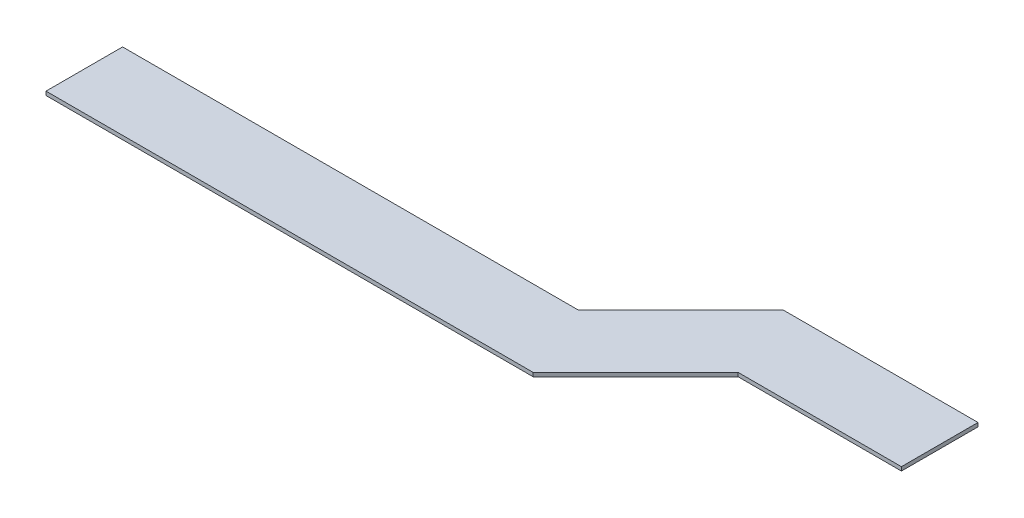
ISO-10303-21;
HEADER;
FILE_DESCRIPTION(('STEP AP214'),'2;1');
FILE_NAME('part.step','',(''),(''),'','','');
FILE_SCHEMA(('AUTOMOTIVE_DESIGN { 1 0 10303 214 1 1 1 1 }'));
ENDSEC;
DATA;
#1=APPLICATION_CONTEXT('core data for automotive mechanical design processes');
#2=APPLICATION_PROTOCOL_DEFINITION('international standard','automotive_design',2000,#1);
#3=PRODUCT_CONTEXT('',#1,'mechanical');
#4=PRODUCT('Part','Part','',(#3));
#5=PRODUCT_RELATED_PRODUCT_CATEGORY('part','',(#4));
#6=PRODUCT_DEFINITION_FORMATION('','',#4);
#7=PRODUCT_DEFINITION_CONTEXT('part definition',#1,'design');
#8=PRODUCT_DEFINITION('design','',#6,#7);
#9=PRODUCT_DEFINITION_SHAPE('','',#8);
#10=(LENGTH_UNIT() NAMED_UNIT(*) SI_UNIT(.MILLI.,.METRE.));
#11=(NAMED_UNIT(*) PLANE_ANGLE_UNIT() SI_UNIT($,.RADIAN.));
#12=(NAMED_UNIT(*) SI_UNIT($,.STERADIAN.) SOLID_ANGLE_UNIT());
#13=UNCERTAINTY_MEASURE_WITH_UNIT(LENGTH_MEASURE(1.E-05),#10,'distance_accuracy_value','');
#14=(GEOMETRIC_REPRESENTATION_CONTEXT(3) GLOBAL_UNCERTAINTY_ASSIGNED_CONTEXT((#13)) GLOBAL_UNIT_ASSIGNED_CONTEXT((#10,
#11,#12)) REPRESENTATION_CONTEXT('',''));
#15=CARTESIAN_POINT('',(0.,0.,0.));
#16=DIRECTION('',(0.,0.,1.));
#17=DIRECTION('',(1.,0.,0.));
#18=AXIS2_PLACEMENT_3D('',#15,#16,#17);
#19=CARTESIAN_POINT('',(-152.9,3.,0.));
#20=DIRECTION('',(0.,0.,1.));
#21=DIRECTION('',(1.,0.,0.));
#22=AXIS2_PLACEMENT_3D('',#19,#20,#21);
#23=PLANE('',#22);
#24=DIRECTION('',(-1.,0.,0.));
#25=VECTOR('',#24,1.);
#26=CARTESIAN_POINT('',(-152.9,0.,0.));
#27=LINE('',#26,#25);
#28=CARTESIAN_POINT('',(0.,0.,0.));
#29=VERTEX_POINT('',#28);
#30=CARTESIAN_POINT('',(-152.9,0.,0.));
#31=VERTEX_POINT('',#30);
#32=EDGE_CURVE('E99',#29,#31,#27,.T.);
#33=ORIENTED_EDGE('',*,*,#32,.T.);
#34=DIRECTION('',(0.,-1.,0.));
#35=VECTOR('',#34,1.);
#36=CARTESIAN_POINT('',(-152.9,3.,0.));
#37=LINE('',#36,#35);
#38=CARTESIAN_POINT('',(-152.9,3.,0.));
#39=VERTEX_POINT('',#38);
#40=EDGE_CURVE('E11',#39,#31,#37,.T.);
#41=ORIENTED_EDGE('',*,*,#40,.F.);
#42=DIRECTION('',(-1.,0.,0.));
#43=VECTOR('',#42,1.);
#44=CARTESIAN_POINT('',(-152.9,3.,0.));
#45=LINE('',#44,#43);
#46=CARTESIAN_POINT('',(0.,3.,0.));
#47=VERTEX_POINT('',#46);
#48=EDGE_CURVE('E126',#47,#39,#45,.T.);
#49=ORIENTED_EDGE('',*,*,#48,.F.);
#50=DIRECTION('',(0.,-1.,0.));
#51=VECTOR('',#50,1.);
#52=CARTESIAN_POINT('',(0.,3.,0.));
#53=LINE('',#52,#51);
#54=EDGE_CURVE('E112',#47,#29,#53,.T.);
#55=ORIENTED_EDGE('',*,*,#54,.T.);
#56=EDGE_LOOP('',(#33,#41,#49,#55));
#57=FACE_BOUND('',#56,.T.);
#58=ADVANCED_FACE('F31',(#57),#23,.F.);
#59=CARTESIAN_POINT('',(-233.2,3.,80.3000000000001));
#60=DIRECTION('',(0.707106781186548,0.,0.707106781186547));
#61=DIRECTION('',(0.707106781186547,0.,-0.707106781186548));
#62=AXIS2_PLACEMENT_3D('',#59,#60,#61);
#63=PLANE('',#62);
#64=DIRECTION('',(-0.707106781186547,0.,0.707106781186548));
#65=VECTOR('',#64,1.);
#66=CARTESIAN_POINT('',(-233.2,0.,80.3000000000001));
#67=LINE('',#66,#65);
#68=CARTESIAN_POINT('',(-233.2,0.,80.3000000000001));
#69=VERTEX_POINT('',#68);
#70=EDGE_CURVE('E95',#31,#69,#67,.T.);
#71=ORIENTED_EDGE('',*,*,#70,.T.);
#72=DIRECTION('',(0.,-1.,0.));
#73=VECTOR('',#72,1.);
#74=CARTESIAN_POINT('',(-233.2,3.,80.3000000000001));
#75=LINE('',#74,#73);
#76=CARTESIAN_POINT('',(-233.2,3.,80.3000000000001));
#77=VERTEX_POINT('',#76);
#78=EDGE_CURVE('E38',#77,#69,#75,.T.);
#79=ORIENTED_EDGE('',*,*,#78,.F.);
#80=DIRECTION('',(-0.707106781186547,0.,0.707106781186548));
#81=VECTOR('',#80,1.);
#82=CARTESIAN_POINT('',(-233.2,3.,80.3000000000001));
#83=LINE('',#82,#81);
#84=EDGE_CURVE('E108',#39,#77,#83,.T.);
#85=ORIENTED_EDGE('',*,*,#84,.F.);
#86=ORIENTED_EDGE('',*,*,#40,.T.);
#87=EDGE_LOOP('',(#71,#79,#85,#86));
#88=FACE_BOUND('',#87,.T.);
#89=ADVANCED_FACE('F107',(#88),#63,.F.);
#90=CARTESIAN_POINT('',(-590.,3.,80.3000000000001));
#91=DIRECTION('',(0.,0.,1.));
#92=DIRECTION('',(1.,0.,0.));
#93=AXIS2_PLACEMENT_3D('',#90,#91,#92);
#94=PLANE('',#93);
#95=DIRECTION('',(-1.,0.,0.));
#96=VECTOR('',#95,1.);
#97=CARTESIAN_POINT('',(-590.,0.,80.3000000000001));
#98=LINE('',#97,#96);
#99=CARTESIAN_POINT('',(-590.,0.,80.3000000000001));
#100=VERTEX_POINT('',#99);
#101=EDGE_CURVE('E101',#69,#100,#98,.T.);
#102=ORIENTED_EDGE('',*,*,#101,.T.);
#103=DIRECTION('',(0.,-1.,0.));
#104=VECTOR('',#103,1.);
#105=CARTESIAN_POINT('',(-590.,3.,80.3000000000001));
#106=LINE('',#105,#104);
#107=CARTESIAN_POINT('',(-590.,3.,80.3000000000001));
#108=VERTEX_POINT('',#107);
#109=EDGE_CURVE('E152',#108,#100,#106,.T.);
#110=ORIENTED_EDGE('',*,*,#109,.F.);
#111=DIRECTION('',(-1.,0.,0.));
#112=VECTOR('',#111,1.);
#113=CARTESIAN_POINT('',(-590.,3.,80.3000000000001));
#114=LINE('',#113,#112);
#115=EDGE_CURVE('E129',#77,#108,#114,.T.);
#116=ORIENTED_EDGE('',*,*,#115,.F.);
#117=ORIENTED_EDGE('',*,*,#78,.T.);
#118=EDGE_LOOP('',(#102,#110,#116,#117));
#119=FACE_BOUND('',#118,.T.);
#120=ADVANCED_FACE('F156',(#119),#94,.F.);
#121=CARTESIAN_POINT('',(-590.,3.,140.3));
#122=DIRECTION('',(1.,0.,0.));
#123=DIRECTION('',(0.,0.,-1.));
#124=AXIS2_PLACEMENT_3D('',#121,#122,#123);
#125=PLANE('',#124);
#126=DIRECTION('',(0.,0.,1.));
#127=VECTOR('',#126,1.);
#128=CARTESIAN_POINT('',(-590.,0.,140.3));
#129=LINE('',#128,#127);
#130=CARTESIAN_POINT('',(-590.,0.,140.3));
#131=VERTEX_POINT('',#130);
#132=EDGE_CURVE('E116',#100,#131,#129,.T.);
#133=ORIENTED_EDGE('',*,*,#132,.T.);
#134=DIRECTION('',(0.,-1.,0.));
#135=VECTOR('',#134,1.);
#136=CARTESIAN_POINT('',(-590.,3.,140.3));
#137=LINE('',#136,#135);
#138=CARTESIAN_POINT('',(-590.,3.,140.3));
#139=VERTEX_POINT('',#138);
#140=EDGE_CURVE('E149',#139,#131,#137,.T.);
#141=ORIENTED_EDGE('',*,*,#140,.F.);
#142=DIRECTION('',(0.,0.,1.));
#143=VECTOR('',#142,1.);
#144=CARTESIAN_POINT('',(-590.,3.,140.3));
#145=LINE('',#144,#143);
#146=EDGE_CURVE('E131',#108,#139,#145,.T.);
#147=ORIENTED_EDGE('',*,*,#146,.F.);
#148=ORIENTED_EDGE('',*,*,#109,.T.);
#149=EDGE_LOOP('',(#133,#141,#147,#148));
#150=FACE_BOUND('',#149,.T.);
#151=ADVANCED_FACE('F164',(#150),#125,.F.);
#152=CARTESIAN_POINT('',(-208.3,3.,140.3));
#153=DIRECTION('',(0.,0.,-1.));
#154=DIRECTION('',(-1.,0.,0.));
#155=AXIS2_PLACEMENT_3D('',#152,#153,#154);
#156=PLANE('',#155);
#157=DIRECTION('',(1.,0.,0.));
#158=VECTOR('',#157,1.);
#159=CARTESIAN_POINT('',(-208.3,0.,140.3));
#160=LINE('',#159,#158);
#161=CARTESIAN_POINT('',(-208.3,0.,140.3));
#162=VERTEX_POINT('',#161);
#163=EDGE_CURVE('E118',#131,#162,#160,.T.);
#164=ORIENTED_EDGE('',*,*,#163,.T.);
#165=DIRECTION('',(0.,-1.,0.));
#166=VECTOR('',#165,1.);
#167=CARTESIAN_POINT('',(-208.3,3.,140.3));
#168=LINE('',#167,#166);
#169=CARTESIAN_POINT('',(-208.3,3.,140.3));
#170=VERTEX_POINT('',#169);
#171=EDGE_CURVE('E146',#170,#162,#168,.T.);
#172=ORIENTED_EDGE('',*,*,#171,.F.);
#173=DIRECTION('',(1.,0.,0.));
#174=VECTOR('',#173,1.);
#175=CARTESIAN_POINT('',(-208.3,3.,140.3));
#176=LINE('',#175,#174);
#177=EDGE_CURVE('E133',#139,#170,#176,.T.);
#178=ORIENTED_EDGE('',*,*,#177,.F.);
#179=ORIENTED_EDGE('',*,*,#140,.T.);
#180=EDGE_LOOP('',(#164,#172,#178,#179));
#181=FACE_BOUND('',#180,.T.);
#182=ADVANCED_FACE('F167',(#181),#156,.F.);
#183=CARTESIAN_POINT('',(-128.,3.,60.));
#184=DIRECTION('',(-0.707106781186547,0.,-0.707106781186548));
#185=DIRECTION('',(-0.707106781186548,0.,0.707106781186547));
#186=AXIS2_PLACEMENT_3D('',#183,#184,#185);
#187=PLANE('',#186);
#188=DIRECTION('',(0.707106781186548,0.,-0.707106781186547));
#189=VECTOR('',#188,1.);
#190=CARTESIAN_POINT('',(-128.,0.,60.));
#191=LINE('',#190,#189);
#192=CARTESIAN_POINT('',(-128.,0.,60.));
#193=VERTEX_POINT('',#192);
#194=EDGE_CURVE('E120',#162,#193,#191,.T.);
#195=ORIENTED_EDGE('',*,*,#194,.T.);
#196=DIRECTION('',(0.,-1.,0.));
#197=VECTOR('',#196,1.);
#198=CARTESIAN_POINT('',(-128.,3.,60.));
#199=LINE('',#198,#197);
#200=CARTESIAN_POINT('',(-128.,3.,60.));
#201=VERTEX_POINT('',#200);
#202=EDGE_CURVE('E143',#201,#193,#199,.T.);
#203=ORIENTED_EDGE('',*,*,#202,.F.);
#204=DIRECTION('',(0.707106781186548,0.,-0.707106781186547));
#205=VECTOR('',#204,1.);
#206=CARTESIAN_POINT('',(-128.,3.,60.));
#207=LINE('',#206,#205);
#208=EDGE_CURVE('E135',#170,#201,#207,.T.);
#209=ORIENTED_EDGE('',*,*,#208,.F.);
#210=ORIENTED_EDGE('',*,*,#171,.T.);
#211=EDGE_LOOP('',(#195,#203,#209,#210));
#212=FACE_BOUND('',#211,.T.);
#213=ADVANCED_FACE('F172',(#212),#187,.F.);
#214=CARTESIAN_POINT('',(0.,3.,60.));
#215=DIRECTION('',(0.,0.,-1.));
#216=DIRECTION('',(-1.,0.,0.));
#217=AXIS2_PLACEMENT_3D('',#214,#215,#216);
#218=PLANE('',#217);
#219=DIRECTION('',(1.,0.,0.));
#220=VECTOR('',#219,1.);
#221=CARTESIAN_POINT('',(0.,0.,60.));
#222=LINE('',#221,#220);
#223=CARTESIAN_POINT('',(0.,0.,60.));
#224=VERTEX_POINT('',#223);
#225=EDGE_CURVE('E122',#193,#224,#222,.T.);
#226=ORIENTED_EDGE('',*,*,#225,.T.);
#227=DIRECTION('',(0.,-1.,0.));
#228=VECTOR('',#227,1.);
#229=CARTESIAN_POINT('',(0.,3.,60.));
#230=LINE('',#229,#228);
#231=CARTESIAN_POINT('',(0.,3.,60.));
#232=VERTEX_POINT('',#231);
#233=EDGE_CURVE('E140',#232,#224,#230,.T.);
#234=ORIENTED_EDGE('',*,*,#233,.F.);
#235=DIRECTION('',(1.,0.,0.));
#236=VECTOR('',#235,1.);
#237=CARTESIAN_POINT('',(0.,3.,60.));
#238=LINE('',#237,#236);
#239=EDGE_CURVE('E50',#201,#232,#238,.T.);
#240=ORIENTED_EDGE('',*,*,#239,.F.);
#241=ORIENTED_EDGE('',*,*,#202,.T.);
#242=EDGE_LOOP('',(#226,#234,#240,#241));
#243=FACE_BOUND('',#242,.T.);
#244=ADVANCED_FACE('F175',(#243),#218,.F.);
#245=CARTESIAN_POINT('',(0.,3.,0.));
#246=DIRECTION('',(-1.,0.,0.));
#247=DIRECTION('',(0.,0.,1.));
#248=AXIS2_PLACEMENT_3D('',#245,#246,#247);
#249=PLANE('',#248);
#250=DIRECTION('',(0.,0.,-1.));
#251=VECTOR('',#250,1.);
#252=CARTESIAN_POINT('',(0.,0.,0.));
#253=LINE('',#252,#251);
#254=EDGE_CURVE('E124',#224,#29,#253,.T.);
#255=ORIENTED_EDGE('',*,*,#254,.T.);
#256=ORIENTED_EDGE('',*,*,#54,.F.);
#257=DIRECTION('',(0.,0.,-1.));
#258=VECTOR('',#257,1.);
#259=CARTESIAN_POINT('',(0.,3.,0.));
#260=LINE('',#259,#258);
#261=EDGE_CURVE('E45',#232,#47,#260,.T.);
#262=ORIENTED_EDGE('',*,*,#261,.F.);
#263=ORIENTED_EDGE('',*,*,#233,.T.);
#264=EDGE_LOOP('',(#255,#256,#262,#263));
#265=FACE_BOUND('',#264,.T.);
#266=ADVANCED_FACE('F177',(#265),#249,.F.);
#267=CARTESIAN_POINT('',(-590.,3.,0.));
#268=DIRECTION('',(0.,1.,0.));
#269=DIRECTION('',(0.,0.,1.));
#270=AXIS2_PLACEMENT_3D('',#267,#268,#269);
#271=PLANE('',#270);
#272=ORIENTED_EDGE('',*,*,#48,.T.);
#273=ORIENTED_EDGE('',*,*,#84,.T.);
#274=ORIENTED_EDGE('',*,*,#115,.T.);
#275=ORIENTED_EDGE('',*,*,#146,.T.);
#276=ORIENTED_EDGE('',*,*,#177,.T.);
#277=ORIENTED_EDGE('',*,*,#208,.T.);
#278=ORIENTED_EDGE('',*,*,#239,.T.);
#279=ORIENTED_EDGE('',*,*,#261,.T.);
#280=EDGE_LOOP('',(#272,#273,#274,#275,#276,#277,#278,#279));
#281=FACE_BOUND('',#280,.T.);
#282=ADVANCED_FACE('F159',(#281),#271,.T.);
#283=CARTESIAN_POINT('',(-590.,0.,0.));
#284=DIRECTION('',(0.,1.,0.));
#285=DIRECTION('',(0.,0.,1.));
#286=AXIS2_PLACEMENT_3D('',#283,#284,#285);
#287=PLANE('',#286);
#288=ORIENTED_EDGE('',*,*,#32,.F.);
#289=ORIENTED_EDGE('',*,*,#254,.F.);
#290=ORIENTED_EDGE('',*,*,#225,.F.);
#291=ORIENTED_EDGE('',*,*,#194,.F.);
#292=ORIENTED_EDGE('',*,*,#163,.F.);
#293=ORIENTED_EDGE('',*,*,#132,.F.);
#294=ORIENTED_EDGE('',*,*,#101,.F.);
#295=ORIENTED_EDGE('',*,*,#70,.F.);
#296=EDGE_LOOP('',(#288,#289,#290,#291,#292,#293,#294,#295));
#297=FACE_BOUND('',#296,.T.);
#298=ADVANCED_FACE('F96',(#297),#287,.F.);
#299=CLOSED_SHELL('',(#58,#89,#120,#151,#182,#213,#244,#266,#282,#298));
#300=MANIFOLD_SOLID_BREP('B2',#299);
#301=ADVANCED_BREP_SHAPE_REPRESENTATION('',(#18,#300),#14);
#302=SHAPE_DEFINITION_REPRESENTATION(#9,#301);
ENDSEC;
END-ISO-10303-21;
